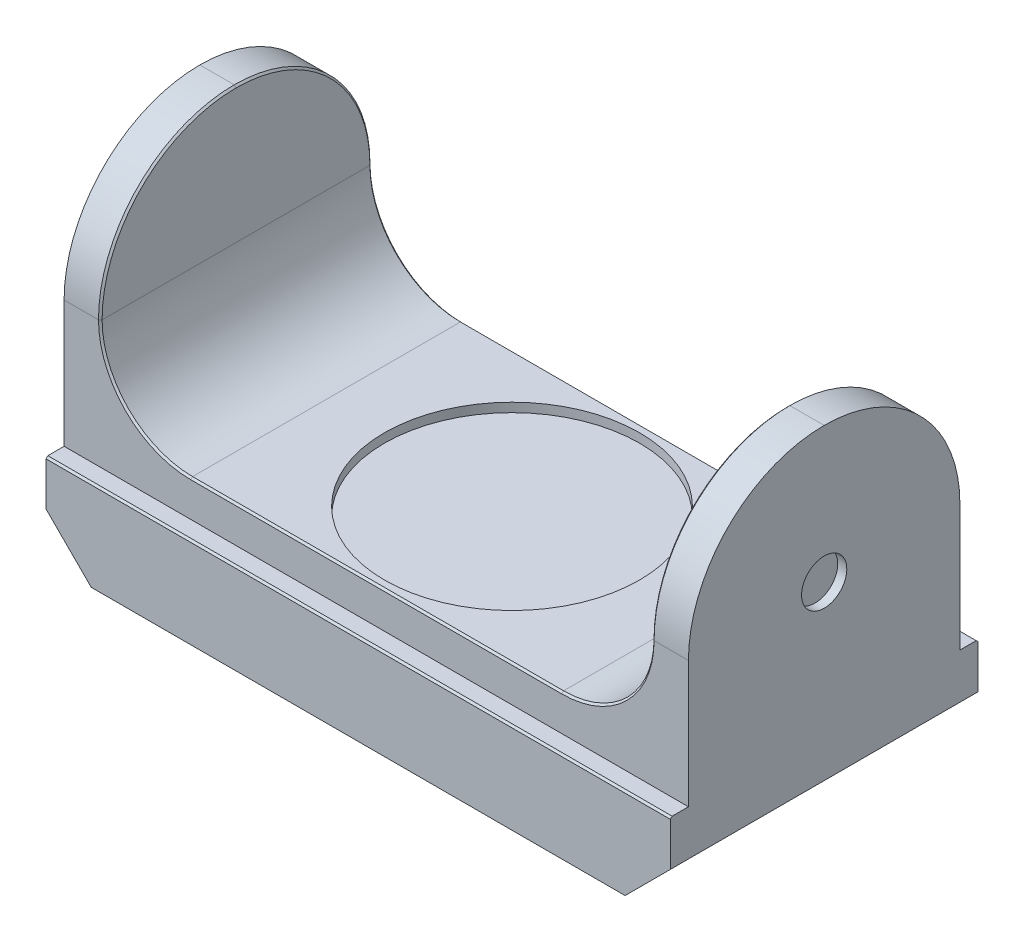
ISO-10303-21;
HEADER;
FILE_DESCRIPTION(('STEP AP214'),'2;1');
FILE_NAME('part.step','',(''),(''),'','','');
FILE_SCHEMA(('AUTOMOTIVE_DESIGN { 1 0 10303 214 1 1 1 1 }'));
ENDSEC;
DATA;
#1=APPLICATION_CONTEXT('core data for automotive mechanical design processes');
#2=APPLICATION_PROTOCOL_DEFINITION('international standard','automotive_design',2000,#1);
#3=PRODUCT_CONTEXT('',#1,'mechanical');
#4=PRODUCT('Part','Part','',(#3));
#5=PRODUCT_RELATED_PRODUCT_CATEGORY('part','',(#4));
#6=PRODUCT_DEFINITION_FORMATION('','',#4);
#7=PRODUCT_DEFINITION_CONTEXT('part definition',#1,'design');
#8=PRODUCT_DEFINITION('design','',#6,#7);
#9=PRODUCT_DEFINITION_SHAPE('','',#8);
#10=(LENGTH_UNIT() NAMED_UNIT(*) SI_UNIT(.MILLI.,.METRE.));
#11=(NAMED_UNIT(*) PLANE_ANGLE_UNIT() SI_UNIT($,.RADIAN.));
#12=(NAMED_UNIT(*) SI_UNIT($,.STERADIAN.) SOLID_ANGLE_UNIT());
#13=UNCERTAINTY_MEASURE_WITH_UNIT(LENGTH_MEASURE(1.E-05),#10,'distance_accuracy_value','');
#14=(GEOMETRIC_REPRESENTATION_CONTEXT(3) GLOBAL_UNCERTAINTY_ASSIGNED_CONTEXT((#13)) GLOBAL_UNIT_ASSIGNED_CONTEXT((#10,
#11,#12)) REPRESENTATION_CONTEXT('',''));
#15=CARTESIAN_POINT('',(0.,0.,0.));
#16=DIRECTION('',(0.,0.,1.));
#17=DIRECTION('',(1.,0.,0.));
#18=AXIS2_PLACEMENT_3D('',#15,#16,#17);
#19=CARTESIAN_POINT('',(-345.,290.,150.));
#20=DIRECTION('',(1.,0.,0.));
#21=DIRECTION('',(0.,1.,0.));
#22=AXIS2_PLACEMENT_3D('',#19,#20,#21);
#23=PLANE('',#22);
#24=DIRECTION('',(0.,0.,-1.));
#25=VECTOR('',#24,1.);
#26=CARTESIAN_POINT('',(-345.,0.,170.));
#27=LINE('',#26,#25);
#28=CARTESIAN_POINT('',(-345.,0.,-150.));
#29=VERTEX_POINT('',#28);
#30=CARTESIAN_POINT('',(-345.,0.,-168.));
#31=VERTEX_POINT('',#30);
#32=EDGE_CURVE('E192',#29,#31,#27,.T.);
#33=ORIENTED_EDGE('',*,*,#32,.T.);
#34=DIRECTION('',(0.,0.707106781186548,0.707106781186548));
#35=VECTOR('',#34,1.);
#36=CARTESIAN_POINT('',(-345.,0.,-168.));
#37=LINE('',#36,#35);
#38=CARTESIAN_POINT('',(-345.,-2.,-170.));
#39=VERTEX_POINT('',#38);
#40=EDGE_CURVE('E463',#31,#39,#37,.F.);
#41=ORIENTED_EDGE('',*,*,#40,.T.);
#42=DIRECTION('',(0.,-1.,0.));
#43=VECTOR('',#42,1.);
#44=CARTESIAN_POINT('',(-345.,-100.,-170.));
#45=LINE('',#44,#43);
#46=CARTESIAN_POINT('',(-345.,-50.,-170.));
#47=VERTEX_POINT('',#46);
#48=EDGE_CURVE('E444',#39,#47,#45,.T.);
#49=ORIENTED_EDGE('',*,*,#48,.T.);
#50=DIRECTION('',(0.,0.,1.));
#51=VECTOR('',#50,1.);
#52=CARTESIAN_POINT('',(-345.,-50.,150.));
#53=LINE('',#52,#51);
#54=CARTESIAN_POINT('',(-345.,-50.,170.));
#55=VERTEX_POINT('',#54);
#56=EDGE_CURVE('E290',#47,#55,#53,.T.);
#57=ORIENTED_EDGE('',*,*,#56,.T.);
#58=DIRECTION('',(0.,-1.,0.));
#59=VECTOR('',#58,1.);
#60=CARTESIAN_POINT('',(-345.,-100.,170.));
#61=LINE('',#60,#59);
#62=CARTESIAN_POINT('',(-345.,-2.00000000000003,170.));
#63=VERTEX_POINT('',#62);
#64=EDGE_CURVE('E451',#63,#55,#61,.T.);
#65=ORIENTED_EDGE('',*,*,#64,.F.);
#66=DIRECTION('',(0.,0.707106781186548,-0.707106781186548));
#67=VECTOR('',#66,1.);
#68=CARTESIAN_POINT('',(-345.,-2.,170.));
#69=LINE('',#68,#67);
#70=CARTESIAN_POINT('',(-345.,0.,168.));
#71=VERTEX_POINT('',#70);
#72=EDGE_CURVE('E188',#63,#71,#69,.T.);
#73=ORIENTED_EDGE('',*,*,#72,.T.);
#74=CARTESIAN_POINT('',(-345.,0.,150.));
#75=VERTEX_POINT('',#74);
#76=EDGE_CURVE('E181',#71,#75,#27,.T.);
#77=ORIENTED_EDGE('',*,*,#76,.T.);
#78=DIRECTION('',(0.,-1.,0.));
#79=VECTOR('',#78,1.);
#80=CARTESIAN_POINT('',(-345.,290.,150.));
#81=LINE('',#80,#79);
#82=CARTESIAN_POINT('',(-345.,140.,150.));
#83=VERTEX_POINT('',#82);
#84=EDGE_CURVE('E185',#83,#75,#81,.T.);
#85=ORIENTED_EDGE('',*,*,#84,.F.);
#86=CARTESIAN_POINT('',(-345.,140.,0.));
#87=DIRECTION('',(1.,0.,0.));
#88=DIRECTION('',(0.,1.,0.));
#89=AXIS2_PLACEMENT_3D('',#86,#87,#88);
#90=CIRCLE('',#89,150.);
#91=CARTESIAN_POINT('',(-345.,290.,0.));
#92=VERTEX_POINT('',#91);
#93=EDGE_CURVE('E263',#83,#92,#90,.F.);
#94=ORIENTED_EDGE('',*,*,#93,.T.);
#95=CARTESIAN_POINT('',(-345.,140.,0.));
#96=DIRECTION('',(1.,0.,0.));
#97=DIRECTION('',(0.,1.,0.));
#98=AXIS2_PLACEMENT_3D('',#95,#96,#97);
#99=CIRCLE('',#98,150.);
#100=CARTESIAN_POINT('',(-345.,140.,-150.));
#101=VERTEX_POINT('',#100);
#102=EDGE_CURVE('E235',#92,#101,#99,.F.);
#103=ORIENTED_EDGE('',*,*,#102,.T.);
#104=DIRECTION('',(0.,-1.,0.));
#105=VECTOR('',#104,1.);
#106=CARTESIAN_POINT('',(-345.,290.,-150.));
#107=LINE('',#106,#105);
#108=EDGE_CURVE('E218',#101,#29,#107,.T.);
#109=ORIENTED_EDGE('',*,*,#108,.T.);
#110=EDGE_LOOP('',(#33,#41,#49,#57,#65,#73,#77,#85,#94,#103,#109));
#111=FACE_BOUND('',#110,.T.);
#112=ADVANCED_FACE('F26',(#111),#23,.F.);
#113=CARTESIAN_POINT('',(345.,0.,150.));
#114=DIRECTION('',(-1.,0.,0.));
#115=DIRECTION('',(0.,-1.,0.));
#116=AXIS2_PLACEMENT_3D('',#113,#114,#115);
#117=PLANE('',#116);
#118=CARTESIAN_POINT('',(345.,140.,0.));
#119=DIRECTION('',(1.,0.,0.));
#120=DIRECTION('',(0.,1.,0.));
#121=AXIS2_PLACEMENT_3D('',#118,#119,#120);
#122=CIRCLE('',#121,25.);
#123=CARTESIAN_POINT('',(345.,165.,0.));
#124=VERTEX_POINT('',#123);
#125=EDGE_CURVE('E438',#124,#124,#122,.T.);
#126=ORIENTED_EDGE('',*,*,#125,.F.);
#127=EDGE_LOOP('',(#126));
#128=FACE_BOUND('',#127,.T.);
#129=DIRECTION('',(0.,1.,0.));
#130=VECTOR('',#129,1.);
#131=CARTESIAN_POINT('',(345.,0.,-170.));
#132=LINE('',#131,#130);
#133=CARTESIAN_POINT('',(345.,-50.0000000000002,-170.));
#134=VERTEX_POINT('',#133);
#135=CARTESIAN_POINT('',(345.,-1.99999999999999,-170.));
#136=VERTEX_POINT('',#135);
#137=EDGE_CURVE('E449',#134,#136,#132,.T.);
#138=ORIENTED_EDGE('',*,*,#137,.T.);
#139=DIRECTION('',(0.,-0.707106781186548,-0.707106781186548));
#140=VECTOR('',#139,1.);
#141=CARTESIAN_POINT('',(345.,-1.3207825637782E-13,-168.));
#142=LINE('',#141,#140);
#143=CARTESIAN_POINT('',(345.,0.,-168.));
#144=VERTEX_POINT('',#143);
#145=EDGE_CURVE('E317',#136,#144,#142,.F.);
#146=ORIENTED_EDGE('',*,*,#145,.T.);
#147=DIRECTION('',(0.,0.,-1.));
#148=VECTOR('',#147,1.);
#149=CARTESIAN_POINT('',(345.,0.,170.));
#150=LINE('',#149,#148);
#151=CARTESIAN_POINT('',(345.,0.,-150.));
#152=VERTEX_POINT('',#151);
#153=EDGE_CURVE('E191',#152,#144,#150,.T.);
#154=ORIENTED_EDGE('',*,*,#153,.F.);
#155=DIRECTION('',(0.,1.,0.));
#156=VECTOR('',#155,1.);
#157=CARTESIAN_POINT('',(345.,0.,-150.));
#158=LINE('',#157,#156);
#159=CARTESIAN_POINT('',(345.,140.,-150.));
#160=VERTEX_POINT('',#159);
#161=EDGE_CURVE('E207',#152,#160,#158,.T.);
#162=ORIENTED_EDGE('',*,*,#161,.T.);
#163=CARTESIAN_POINT('',(345.,140.,0.));
#164=DIRECTION('',(-1.,0.,0.));
#165=DIRECTION('',(0.,-1.,0.));
#166=AXIS2_PLACEMENT_3D('',#163,#164,#165);
#167=CIRCLE('',#166,150.);
#168=CARTESIAN_POINT('',(345.,290.,0.));
#169=VERTEX_POINT('',#168);
#170=EDGE_CURVE('E258',#160,#169,#167,.F.);
#171=ORIENTED_EDGE('',*,*,#170,.T.);
#172=CARTESIAN_POINT('',(345.,140.,0.));
#173=DIRECTION('',(-1.,0.,0.));
#174=DIRECTION('',(0.,-1.,0.));
#175=AXIS2_PLACEMENT_3D('',#172,#173,#174);
#176=CIRCLE('',#175,150.);
#177=CARTESIAN_POINT('',(345.,140.,150.));
#178=VERTEX_POINT('',#177);
#179=EDGE_CURVE('E256',#169,#178,#176,.F.);
#180=ORIENTED_EDGE('',*,*,#179,.T.);
#181=DIRECTION('',(0.,1.,0.));
#182=VECTOR('',#181,1.);
#183=CARTESIAN_POINT('',(345.,0.,150.));
#184=LINE('',#183,#182);
#185=CARTESIAN_POINT('',(345.,0.,150.));
#186=VERTEX_POINT('',#185);
#187=EDGE_CURVE('E202',#186,#178,#184,.T.);
#188=ORIENTED_EDGE('',*,*,#187,.F.);
#189=CARTESIAN_POINT('',(345.,0.,168.));
#190=VERTEX_POINT('',#189);
#191=EDGE_CURVE('E198',#190,#186,#150,.T.);
#192=ORIENTED_EDGE('',*,*,#191,.F.);
#193=DIRECTION('',(0.,-0.707106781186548,0.707106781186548));
#194=VECTOR('',#193,1.);
#195=CARTESIAN_POINT('',(345.,-2.00000000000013,170.));
#196=LINE('',#195,#194);
#197=CARTESIAN_POINT('',(345.,-1.99999999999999,170.));
#198=VERTEX_POINT('',#197);
#199=EDGE_CURVE('E315',#190,#198,#196,.T.);
#200=ORIENTED_EDGE('',*,*,#199,.T.);
#201=DIRECTION('',(0.,1.,0.));
#202=VECTOR('',#201,1.);
#203=CARTESIAN_POINT('',(345.,0.,170.));
#204=LINE('',#203,#202);
#205=CARTESIAN_POINT('',(345.,-50.,170.));
#206=VERTEX_POINT('',#205);
#207=EDGE_CURVE('E301',#206,#198,#204,.T.);
#208=ORIENTED_EDGE('',*,*,#207,.F.);
#209=DIRECTION('',(0.,0.,-1.));
#210=VECTOR('',#209,1.);
#211=CARTESIAN_POINT('',(345.,-50.0000000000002,150.));
#212=LINE('',#211,#210);
#213=EDGE_CURVE('E264',#206,#134,#212,.T.);
#214=ORIENTED_EDGE('',*,*,#213,.T.);
#215=EDGE_LOOP('',(#138,#146,#154,#162,#171,#180,#188,#192,#200,#208,#214));
#216=FACE_BOUND('',#215,.T.);
#217=ADVANCED_FACE('F470',(#128,#216),#117,.F.);
#218=CARTESIAN_POINT('',(305.,290.,150.));
#219=DIRECTION('',(1.,0.,0.));
#220=DIRECTION('',(0.,0.,-1.));
#221=AXIS2_PLACEMENT_3D('',#218,#219,#220);
#222=PLANE('',#221);
#223=CARTESIAN_POINT('',(305.,140.,0.));
#224=DIRECTION('',(1.,0.,0.));
#225=DIRECTION('',(0.,0.,-1.));
#226=AXIS2_PLACEMENT_3D('',#223,#224,#225);
#227=CIRCLE('',#226,148.);
#228=CARTESIAN_POINT('',(305.,140.000000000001,148.));
#229=VERTEX_POINT('',#228);
#230=CARTESIAN_POINT('',(305.,288.,0.));
#231=VERTEX_POINT('',#230);
#232=EDGE_CURVE('E336',#229,#231,#227,.F.);
#233=ORIENTED_EDGE('',*,*,#232,.T.);
#234=CARTESIAN_POINT('',(305.,140.,0.));
#235=DIRECTION('',(1.,0.,0.));
#236=DIRECTION('',(0.,0.,-1.));
#237=AXIS2_PLACEMENT_3D('',#234,#235,#236);
#238=CIRCLE('',#237,148.);
#239=CARTESIAN_POINT('',(305.,140.000000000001,-148.));
#240=VERTEX_POINT('',#239);
#241=EDGE_CURVE('E338',#231,#240,#238,.F.);
#242=ORIENTED_EDGE('',*,*,#241,.T.);
#243=DIRECTION('',(0.,0.,-1.));
#244=VECTOR('',#243,1.);
#245=CARTESIAN_POINT('',(305.,140.000000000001,150.));
#246=LINE('',#245,#244);
#247=EDGE_CURVE('E246',#229,#240,#246,.T.);
#248=ORIENTED_EDGE('',*,*,#247,.F.);
#249=EDGE_LOOP('',(#233,#242,#248));
#250=FACE_BOUND('',#249,.T.);
#251=ADVANCED_FACE('F495',(#250),#222,.F.);
#252=CARTESIAN_POINT('',(205.,140.,150.));
#253=DIRECTION('',(0.,0.,-1.));
#254=DIRECTION('',(-1.,0.,0.));
#255=AXIS2_PLACEMENT_3D('',#252,#253,#254);
#256=CYLINDRICAL_SURFACE('',#255,100.);
#257=ORIENTED_EDGE('',*,*,#247,.T.);
#258=CARTESIAN_POINT('',(205.,140.,-148.));
#259=DIRECTION('',(0.,0.,-1.));
#260=DIRECTION('',(-1.,0.,0.));
#261=AXIS2_PLACEMENT_3D('',#258,#259,#260);
#262=CIRCLE('',#261,100.);
#263=CARTESIAN_POINT('',(204.999999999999,39.9999999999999,-148.));
#264=VERTEX_POINT('',#263);
#265=EDGE_CURVE('E326',#240,#264,#262,.T.);
#266=ORIENTED_EDGE('',*,*,#265,.T.);
#267=DIRECTION('',(0.,0.,-1.));
#268=VECTOR('',#267,1.);
#269=CARTESIAN_POINT('',(204.999999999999,39.9999999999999,150.));
#270=LINE('',#269,#268);
#271=CARTESIAN_POINT('',(204.999999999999,39.9999999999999,148.));
#272=VERTEX_POINT('',#271);
#273=EDGE_CURVE('E241',#272,#264,#270,.T.);
#274=ORIENTED_EDGE('',*,*,#273,.F.);
#275=CARTESIAN_POINT('',(205.,140.,148.));
#276=DIRECTION('',(0.,0.,-1.));
#277=DIRECTION('',(-1.,0.,0.));
#278=AXIS2_PLACEMENT_3D('',#275,#276,#277);
#279=CIRCLE('',#278,100.);
#280=EDGE_CURVE('E324',#272,#229,#279,.F.);
#281=ORIENTED_EDGE('',*,*,#280,.T.);
#282=EDGE_LOOP('',(#257,#266,#274,#281));
#283=FACE_BOUND('',#282,.T.);
#284=ADVANCED_FACE('F500',(#283),#256,.F.);
#285=CARTESIAN_POINT('',(204.999999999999,39.9999999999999,150.));
#286=DIRECTION('',(0.,-1.,0.));
#287=DIRECTION('',(0.,0.,-1.));
#288=AXIS2_PLACEMENT_3D('',#285,#286,#287);
#289=PLANE('',#288);
#290=CARTESIAN_POINT('',(0.,39.9999999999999,0.));
#291=DIRECTION('',(0.,1.,0.));
#292=DIRECTION('',(0.,0.,1.));
#293=AXIS2_PLACEMENT_3D('',#290,#291,#292);
#294=CIRCLE('',#293,141.);
#295=CARTESIAN_POINT('',(0.,39.9999999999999,141.));
#296=VERTEX_POINT('',#295);
#297=EDGE_CURVE('E432',#296,#296,#294,.T.);
#298=ORIENTED_EDGE('',*,*,#297,.F.);
#299=EDGE_LOOP('',(#298));
#300=FACE_BOUND('',#299,.T.);
#301=ORIENTED_EDGE('',*,*,#273,.T.);
#302=DIRECTION('',(-1.,0.,0.));
#303=VECTOR('',#302,1.);
#304=CARTESIAN_POINT('',(-204.999999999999,39.9999999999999,-148.));
#305=LINE('',#304,#303);
#306=CARTESIAN_POINT('',(-204.999999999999,39.9999999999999,-148.));
#307=VERTEX_POINT('',#306);
#308=EDGE_CURVE('E344',#264,#307,#305,.T.);
#309=ORIENTED_EDGE('',*,*,#308,.T.);
#310=DIRECTION('',(0.,0.,-1.));
#311=VECTOR('',#310,1.);
#312=CARTESIAN_POINT('',(-204.999999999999,39.9999999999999,150.));
#313=LINE('',#312,#311);
#314=CARTESIAN_POINT('',(-204.999999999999,39.9999999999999,148.));
#315=VERTEX_POINT('',#314);
#316=EDGE_CURVE('E238',#315,#307,#313,.T.);
#317=ORIENTED_EDGE('',*,*,#316,.F.);
#318=DIRECTION('',(1.,0.,0.));
#319=VECTOR('',#318,1.);
#320=CARTESIAN_POINT('',(204.999999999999,39.9999999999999,148.));
#321=LINE('',#320,#319);
#322=EDGE_CURVE('E342',#315,#272,#321,.T.);
#323=ORIENTED_EDGE('',*,*,#322,.T.);
#324=EDGE_LOOP('',(#301,#309,#317,#323));
#325=FACE_BOUND('',#324,.T.);
#326=ADVANCED_FACE('F507',(#300,#325),#289,.F.);
#327=CARTESIAN_POINT('',(-205.,140.,150.));
#328=DIRECTION('',(0.,0.,-1.));
#329=DIRECTION('',(-1.,0.,0.));
#330=AXIS2_PLACEMENT_3D('',#327,#328,#329);
#331=CYLINDRICAL_SURFACE('',#330,100.);
#332=ORIENTED_EDGE('',*,*,#316,.T.);
#333=CARTESIAN_POINT('',(-205.,140.,-148.));
#334=DIRECTION('',(0.,0.,-1.));
#335=DIRECTION('',(-1.,0.,0.));
#336=AXIS2_PLACEMENT_3D('',#333,#334,#335);
#337=CIRCLE('',#336,100.);
#338=CARTESIAN_POINT('',(-305.,140.000000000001,-148.));
#339=VERTEX_POINT('',#338);
#340=EDGE_CURVE('E350',#307,#339,#337,.T.);
#341=ORIENTED_EDGE('',*,*,#340,.T.);
#342=DIRECTION('',(0.,0.,-1.));
#343=VECTOR('',#342,1.);
#344=CARTESIAN_POINT('',(-305.,140.000000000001,150.));
#345=LINE('',#344,#343);
#346=CARTESIAN_POINT('',(-305.,140.000000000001,148.));
#347=VERTEX_POINT('',#346);
#348=EDGE_CURVE('E232',#347,#339,#345,.T.);
#349=ORIENTED_EDGE('',*,*,#348,.F.);
#350=CARTESIAN_POINT('',(-205.,140.,148.));
#351=DIRECTION('',(0.,0.,-1.));
#352=DIRECTION('',(-1.,0.,0.));
#353=AXIS2_PLACEMENT_3D('',#350,#351,#352);
#354=CIRCLE('',#353,100.);
#355=EDGE_CURVE('E348',#347,#315,#354,.F.);
#356=ORIENTED_EDGE('',*,*,#355,.T.);
#357=EDGE_LOOP('',(#332,#341,#349,#356));
#358=FACE_BOUND('',#357,.T.);
#359=ADVANCED_FACE('F511',(#358),#331,.F.);
#360=CARTESIAN_POINT('',(-305.,140.000000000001,150.));
#361=DIRECTION('',(-1.,0.,0.));
#362=DIRECTION('',(0.,0.,1.));
#363=AXIS2_PLACEMENT_3D('',#360,#361,#362);
#364=PLANE('',#363);
#365=ORIENTED_EDGE('',*,*,#348,.T.);
#366=CARTESIAN_POINT('',(-305.,140.,0.));
#367=DIRECTION('',(-1.,0.,0.));
#368=DIRECTION('',(0.,0.,1.));
#369=AXIS2_PLACEMENT_3D('',#366,#367,#368);
#370=CIRCLE('',#369,148.);
#371=CARTESIAN_POINT('',(-305.,288.,0.));
#372=VERTEX_POINT('',#371);
#373=EDGE_CURVE('E46',#339,#372,#370,.F.);
#374=ORIENTED_EDGE('',*,*,#373,.T.);
#375=CARTESIAN_POINT('',(-305.,140.,0.));
#376=DIRECTION('',(-1.,0.,0.));
#377=DIRECTION('',(0.,0.,1.));
#378=AXIS2_PLACEMENT_3D('',#375,#376,#377);
#379=CIRCLE('',#378,148.);
#380=EDGE_CURVE('E358',#372,#347,#379,.F.);
#381=ORIENTED_EDGE('',*,*,#380,.T.);
#382=EDGE_LOOP('',(#365,#374,#381));
#383=FACE_BOUND('',#382,.T.);
#384=ADVANCED_FACE('F515',(#383),#364,.F.);
#385=CARTESIAN_POINT('',(205.,140.,150.));
#386=DIRECTION('',(0.,0.,-1.));
#387=DIRECTION('',(-1.,0.,0.));
#388=AXIS2_PLACEMENT_3D('',#385,#386,#387);
#389=PLANE('',#388);
#390=DIRECTION('',(-1.,0.,0.));
#391=VECTOR('',#390,1.);
#392=CARTESIAN_POINT('',(205.,140.,150.));
#393=LINE('',#392,#391);
#394=CARTESIAN_POINT('',(307.,140.,150.));
#395=VERTEX_POINT('',#394);
#396=EDGE_CURVE('E262',#178,#395,#393,.T.);
#397=ORIENTED_EDGE('',*,*,#396,.T.);
#398=CARTESIAN_POINT('',(205.,140.,150.));
#399=DIRECTION('',(0.,0.,-1.));
#400=DIRECTION('',(-1.,0.,0.));
#401=AXIS2_PLACEMENT_3D('',#398,#399,#400);
#402=CIRCLE('',#401,102.);
#403=CARTESIAN_POINT('',(204.999999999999,38.0000000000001,150.));
#404=VERTEX_POINT('',#403);
#405=EDGE_CURVE('E356',#395,#404,#402,.T.);
#406=ORIENTED_EDGE('',*,*,#405,.T.);
#407=DIRECTION('',(-1.,0.,0.));
#408=VECTOR('',#407,1.);
#409=CARTESIAN_POINT('',(205.,38.0000000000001,150.));
#410=LINE('',#409,#408);
#411=CARTESIAN_POINT('',(-204.999999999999,38.0000000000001,150.));
#412=VERTEX_POINT('',#411);
#413=EDGE_CURVE('E354',#404,#412,#410,.T.);
#414=ORIENTED_EDGE('',*,*,#413,.T.);
#415=CARTESIAN_POINT('',(-205.,140.,150.));
#416=DIRECTION('',(0.,0.,-1.));
#417=DIRECTION('',(-1.,0.,0.));
#418=AXIS2_PLACEMENT_3D('',#415,#416,#417);
#419=CIRCLE('',#418,102.);
#420=CARTESIAN_POINT('',(-307.,140.,150.));
#421=VERTEX_POINT('',#420);
#422=EDGE_CURVE('E352',#412,#421,#419,.T.);
#423=ORIENTED_EDGE('',*,*,#422,.T.);
#424=DIRECTION('',(-1.,0.,0.));
#425=VECTOR('',#424,1.);
#426=CARTESIAN_POINT('',(205.,140.,150.));
#427=LINE('',#426,#425);
#428=EDGE_CURVE('E206',#421,#83,#427,.T.);
#429=ORIENTED_EDGE('',*,*,#428,.T.);
#430=ORIENTED_EDGE('',*,*,#84,.T.);
#431=DIRECTION('',(1.,0.,0.));
#432=VECTOR('',#431,1.);
#433=CARTESIAN_POINT('',(-345.,0.,150.));
#434=LINE('',#433,#432);
#435=EDGE_CURVE('E195',#75,#186,#434,.T.);
#436=ORIENTED_EDGE('',*,*,#435,.T.);
#437=ORIENTED_EDGE('',*,*,#187,.T.);
#438=EDGE_LOOP('',(#397,#406,#414,#423,#429,#430,#436,#437));
#439=FACE_BOUND('',#438,.T.);
#440=ADVANCED_FACE('F205',(#439),#389,.F.);
#441=CARTESIAN_POINT('',(205.,140.,-150.));
#442=DIRECTION('',(0.,0.,-1.));
#443=DIRECTION('',(-1.,0.,0.));
#444=AXIS2_PLACEMENT_3D('',#441,#442,#443);
#445=PLANE('',#444);
#446=DIRECTION('',(1.,0.,0.));
#447=VECTOR('',#446,1.);
#448=CARTESIAN_POINT('',(204.999999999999,38.0000000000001,-150.));
#449=LINE('',#448,#447);
#450=CARTESIAN_POINT('',(-204.999999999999,38.0000000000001,-150.));
#451=VERTEX_POINT('',#450);
#452=CARTESIAN_POINT('',(204.999999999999,38.0000000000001,-150.));
#453=VERTEX_POINT('',#452);
#454=EDGE_CURVE('E331',#451,#453,#449,.T.);
#455=ORIENTED_EDGE('',*,*,#454,.T.);
#456=CARTESIAN_POINT('',(205.,140.,-150.));
#457=DIRECTION('',(0.,0.,-1.));
#458=DIRECTION('',(-1.,0.,0.));
#459=AXIS2_PLACEMENT_3D('',#456,#457,#458);
#460=CIRCLE('',#459,102.);
#461=CARTESIAN_POINT('',(307.,140.,-150.));
#462=VERTEX_POINT('',#461);
#463=EDGE_CURVE('E333',#453,#462,#460,.F.);
#464=ORIENTED_EDGE('',*,*,#463,.T.);
#465=DIRECTION('',(-1.,0.,0.));
#466=VECTOR('',#465,1.);
#467=CARTESIAN_POINT('',(345.,140.,-150.));
#468=LINE('',#467,#466);
#469=EDGE_CURVE('E254',#462,#160,#468,.F.);
#470=ORIENTED_EDGE('',*,*,#469,.T.);
#471=ORIENTED_EDGE('',*,*,#161,.F.);
#472=DIRECTION('',(1.,0.,0.));
#473=VECTOR('',#472,1.);
#474=CARTESIAN_POINT('',(-345.,0.,-150.));
#475=LINE('',#474,#473);
#476=EDGE_CURVE('E210',#29,#152,#475,.T.);
#477=ORIENTED_EDGE('',*,*,#476,.F.);
#478=ORIENTED_EDGE('',*,*,#108,.F.);
#479=DIRECTION('',(-1.,0.,0.));
#480=VECTOR('',#479,1.);
#481=CARTESIAN_POINT('',(-305.,140.,-150.));
#482=LINE('',#481,#480);
#483=CARTESIAN_POINT('',(-307.,140.,-150.));
#484=VERTEX_POINT('',#483);
#485=EDGE_CURVE('E251',#101,#484,#482,.F.);
#486=ORIENTED_EDGE('',*,*,#485,.T.);
#487=CARTESIAN_POINT('',(-205.,140.,-150.));
#488=DIRECTION('',(0.,0.,-1.));
#489=DIRECTION('',(-1.,0.,0.));
#490=AXIS2_PLACEMENT_3D('',#487,#488,#489);
#491=CIRCLE('',#490,102.);
#492=EDGE_CURVE('E329',#484,#451,#491,.F.);
#493=ORIENTED_EDGE('',*,*,#492,.T.);
#494=EDGE_LOOP('',(#455,#464,#470,#471,#477,#478,#486,#493));
#495=FACE_BOUND('',#494,.T.);
#496=ADVANCED_FACE('F367',(#495),#445,.T.);
#497=CARTESIAN_POINT('',(205.,140.,0.));
#498=DIRECTION('',(-1.,0.,0.));
#499=DIRECTION('',(0.,0.,1.));
#500=AXIS2_PLACEMENT_3D('',#497,#498,#499);
#501=CYLINDRICAL_SURFACE('',#500,150.);
#502=DIRECTION('',(-1.,0.,0.));
#503=VECTOR('',#502,1.);
#504=CARTESIAN_POINT('',(345.,290.,0.));
#505=LINE('',#504,#503);
#506=CARTESIAN_POINT('',(307.,290.,0.));
#507=VERTEX_POINT('',#506);
#508=EDGE_CURVE('E221',#507,#169,#505,.F.);
#509=ORIENTED_EDGE('',*,*,#508,.F.);
#510=CARTESIAN_POINT('',(307.,140.,0.));
#511=DIRECTION('',(1.,0.,0.));
#512=DIRECTION('',(0.,0.,-1.));
#513=AXIS2_PLACEMENT_3D('',#510,#511,#512);
#514=CIRCLE('',#513,150.);
#515=EDGE_CURVE('E346',#507,#395,#514,.T.);
#516=ORIENTED_EDGE('',*,*,#515,.T.);
#517=ORIENTED_EDGE('',*,*,#396,.F.);
#518=ORIENTED_EDGE('',*,*,#179,.F.);
#519=EDGE_LOOP('',(#509,#516,#517,#518));
#520=FACE_BOUND('',#519,.T.);
#521=ADVANCED_FACE('F409',(#520),#501,.T.);
#522=CARTESIAN_POINT('',(345.,140.,0.));
#523=DIRECTION('',(1.,0.,0.));
#524=DIRECTION('',(0.,0.,-1.));
#525=AXIS2_PLACEMENT_3D('',#522,#523,#524);
#526=CYLINDRICAL_SURFACE('',#525,150.);
#527=ORIENTED_EDGE('',*,*,#469,.F.);
#528=CARTESIAN_POINT('',(307.,140.,0.));
#529=DIRECTION('',(1.,0.,0.));
#530=DIRECTION('',(0.,0.,-1.));
#531=AXIS2_PLACEMENT_3D('',#528,#529,#530);
#532=CIRCLE('',#531,150.);
#533=EDGE_CURVE('E340',#462,#507,#532,.T.);
#534=ORIENTED_EDGE('',*,*,#533,.T.);
#535=ORIENTED_EDGE('',*,*,#508,.T.);
#536=ORIENTED_EDGE('',*,*,#170,.F.);
#537=EDGE_LOOP('',(#527,#534,#535,#536));
#538=FACE_BOUND('',#537,.T.);
#539=ADVANCED_FACE('F404',(#538),#526,.T.);
#540=CARTESIAN_POINT('',(205.,140.,0.));
#541=DIRECTION('',(-1.,0.,0.));
#542=DIRECTION('',(0.,0.,1.));
#543=AXIS2_PLACEMENT_3D('',#540,#541,#542);
#544=CYLINDRICAL_SURFACE('',#543,150.);
#545=ORIENTED_EDGE('',*,*,#428,.F.);
#546=CARTESIAN_POINT('',(-307.,140.,0.));
#547=DIRECTION('',(-1.,0.,0.));
#548=DIRECTION('',(0.,0.,1.));
#549=AXIS2_PLACEMENT_3D('',#546,#547,#548);
#550=CIRCLE('',#549,150.);
#551=CARTESIAN_POINT('',(-307.,290.,0.));
#552=VERTEX_POINT('',#551);
#553=EDGE_CURVE('E11',#421,#552,#550,.T.);
#554=ORIENTED_EDGE('',*,*,#553,.T.);
#555=DIRECTION('',(-1.,0.,0.));
#556=VECTOR('',#555,1.);
#557=CARTESIAN_POINT('',(-305.,290.,0.));
#558=LINE('',#557,#556);
#559=EDGE_CURVE('E308',#92,#552,#558,.F.);
#560=ORIENTED_EDGE('',*,*,#559,.F.);
#561=ORIENTED_EDGE('',*,*,#93,.F.);
#562=EDGE_LOOP('',(#545,#554,#560,#561));
#563=FACE_BOUND('',#562,.T.);
#564=ADVANCED_FACE('F487',(#563),#544,.T.);
#565=CARTESIAN_POINT('',(-305.,140.,0.));
#566=DIRECTION('',(1.,0.,0.));
#567=DIRECTION('',(0.,0.,-1.));
#568=AXIS2_PLACEMENT_3D('',#565,#566,#567);
#569=CYLINDRICAL_SURFACE('',#568,150.);
#570=ORIENTED_EDGE('',*,*,#559,.T.);
#571=CARTESIAN_POINT('',(-307.,140.,0.));
#572=DIRECTION('',(-1.,0.,0.));
#573=DIRECTION('',(0.,0.,1.));
#574=AXIS2_PLACEMENT_3D('',#571,#572,#573);
#575=CIRCLE('',#574,150.);
#576=EDGE_CURVE('E33',#552,#484,#575,.T.);
#577=ORIENTED_EDGE('',*,*,#576,.T.);
#578=ORIENTED_EDGE('',*,*,#485,.F.);
#579=ORIENTED_EDGE('',*,*,#102,.F.);
#580=EDGE_LOOP('',(#570,#577,#578,#579));
#581=FACE_BOUND('',#580,.T.);
#582=ADVANCED_FACE('F362',(#581),#569,.T.);
#583=CARTESIAN_POINT('',(-345.,0.,170.));
#584=DIRECTION('',(0.,-1.,0.));
#585=DIRECTION('',(0.,0.,-1.));
#586=AXIS2_PLACEMENT_3D('',#583,#584,#585);
#587=PLANE('',#586);
#588=ORIENTED_EDGE('',*,*,#153,.T.);
#589=DIRECTION('',(-1.,0.,0.));
#590=VECTOR('',#589,1.);
#591=CARTESIAN_POINT('',(-345.,0.,-168.));
#592=LINE('',#591,#590);
#593=EDGE_CURVE('E293',#144,#31,#592,.T.);
#594=ORIENTED_EDGE('',*,*,#593,.T.);
#595=ORIENTED_EDGE('',*,*,#32,.F.);
#596=ORIENTED_EDGE('',*,*,#476,.T.);
#597=EDGE_LOOP('',(#588,#594,#595,#596));
#598=FACE_BOUND('',#597,.T.);
#599=ADVANCED_FACE('F475',(#598),#587,.F.);
#600=CARTESIAN_POINT('',(345.,-100.,170.));
#601=DIRECTION('',(0.,1.,0.));
#602=DIRECTION('',(-1.,0.,0.));
#603=AXIS2_PLACEMENT_3D('',#600,#601,#602);
#604=PLANE('',#603);
#605=DIRECTION('',(1.,0.,0.));
#606=VECTOR('',#605,1.);
#607=CARTESIAN_POINT('',(345.,-100.,-170.));
#608=LINE('',#607,#606);
#609=CARTESIAN_POINT('',(-295.,-100.,-170.));
#610=VERTEX_POINT('',#609);
#611=CARTESIAN_POINT('',(295.,-100.,-170.));
#612=VERTEX_POINT('',#611);
#613=EDGE_CURVE('E446',#610,#612,#608,.T.);
#614=ORIENTED_EDGE('',*,*,#613,.T.);
#615=DIRECTION('',(0.,0.,1.));
#616=VECTOR('',#615,1.);
#617=CARTESIAN_POINT('',(295.,-100.,170.));
#618=LINE('',#617,#616);
#619=CARTESIAN_POINT('',(295.,-99.9999999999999,170.));
#620=VERTEX_POINT('',#619);
#621=EDGE_CURVE('E284',#612,#620,#618,.T.);
#622=ORIENTED_EDGE('',*,*,#621,.T.);
#623=DIRECTION('',(1.,0.,0.));
#624=VECTOR('',#623,1.);
#625=CARTESIAN_POINT('',(345.,-100.,170.));
#626=LINE('',#625,#624);
#627=CARTESIAN_POINT('',(-295.,-100.,170.));
#628=VERTEX_POINT('',#627);
#629=EDGE_CURVE('E452',#628,#620,#626,.T.);
#630=ORIENTED_EDGE('',*,*,#629,.F.);
#631=DIRECTION('',(0.,0.,-1.));
#632=VECTOR('',#631,1.);
#633=CARTESIAN_POINT('',(-295.,-100.,170.));
#634=LINE('',#633,#632);
#635=EDGE_CURVE('E281',#628,#610,#634,.T.);
#636=ORIENTED_EDGE('',*,*,#635,.T.);
#637=EDGE_LOOP('',(#614,#622,#630,#636));
#638=FACE_BOUND('',#637,.T.);
#639=ADVANCED_FACE('F478',(#638),#604,.F.);
#640=ORIENTED_EDGE('',*,*,#76,.F.);
#641=DIRECTION('',(1.,0.,0.));
#642=VECTOR('',#641,1.);
#643=CARTESIAN_POINT('',(345.,0.,168.));
#644=LINE('',#643,#642);
#645=EDGE_CURVE('E322',#71,#190,#644,.T.);
#646=ORIENTED_EDGE('',*,*,#645,.T.);
#647=ORIENTED_EDGE('',*,*,#191,.T.);
#648=ORIENTED_EDGE('',*,*,#435,.F.);
#649=EDGE_LOOP('',(#640,#646,#647,#648));
#650=FACE_BOUND('',#649,.T.);
#651=ADVANCED_FACE('F196',(#650),#587,.F.);
#652=CARTESIAN_POINT('',(-345.,-100.,170.));
#653=DIRECTION('',(0.,0.,1.));
#654=DIRECTION('',(1.,0.,0.));
#655=AXIS2_PLACEMENT_3D('',#652,#653,#654);
#656=PLANE('',#655);
#657=ORIENTED_EDGE('',*,*,#207,.T.);
#658=DIRECTION('',(-1.,0.,0.));
#659=VECTOR('',#658,1.);
#660=CARTESIAN_POINT('',(-345.,-2.,170.));
#661=LINE('',#660,#659);
#662=EDGE_CURVE('E319',#198,#63,#661,.T.);
#663=ORIENTED_EDGE('',*,*,#662,.T.);
#664=ORIENTED_EDGE('',*,*,#64,.T.);
#665=DIRECTION('',(-0.707106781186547,0.707106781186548,0.));
#666=VECTOR('',#665,1.);
#667=CARTESIAN_POINT('',(-320.,-75.0000000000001,170.));
#668=LINE('',#667,#666);
#669=EDGE_CURVE('E286',#55,#628,#668,.F.);
#670=ORIENTED_EDGE('',*,*,#669,.T.);
#671=ORIENTED_EDGE('',*,*,#629,.T.);
#672=DIRECTION('',(-0.707106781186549,-0.707106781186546,0.));
#673=VECTOR('',#672,1.);
#674=CARTESIAN_POINT('',(-25.0000000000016,-420.,170.));
#675=LINE('',#674,#673);
#676=EDGE_CURVE('E288',#620,#206,#675,.F.);
#677=ORIENTED_EDGE('',*,*,#676,.T.);
#678=EDGE_LOOP('',(#657,#663,#664,#670,#671,#677));
#679=FACE_BOUND('',#678,.T.);
#680=ADVANCED_FACE('F459',(#679),#656,.T.);
#681=CARTESIAN_POINT('',(-345.,-100.,-170.));
#682=DIRECTION('',(0.,0.,1.));
#683=DIRECTION('',(1.,0.,0.));
#684=AXIS2_PLACEMENT_3D('',#681,#682,#683);
#685=PLANE('',#684);
#686=ORIENTED_EDGE('',*,*,#48,.F.);
#687=DIRECTION('',(1.,0.,0.));
#688=VECTOR('',#687,1.);
#689=CARTESIAN_POINT('',(-345.,-2.,-170.));
#690=LINE('',#689,#688);
#691=EDGE_CURVE('E314',#39,#136,#690,.T.);
#692=ORIENTED_EDGE('',*,*,#691,.T.);
#693=ORIENTED_EDGE('',*,*,#137,.F.);
#694=DIRECTION('',(0.707106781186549,0.707106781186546,0.));
#695=VECTOR('',#694,1.);
#696=CARTESIAN_POINT('',(345.,-50.0000000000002,-170.));
#697=LINE('',#696,#695);
#698=EDGE_CURVE('E276',#134,#612,#697,.F.);
#699=ORIENTED_EDGE('',*,*,#698,.T.);
#700=ORIENTED_EDGE('',*,*,#613,.F.);
#701=DIRECTION('',(0.707106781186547,-0.707106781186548,0.));
#702=VECTOR('',#701,1.);
#703=CARTESIAN_POINT('',(-295.,-100.,-170.));
#704=LINE('',#703,#702);
#705=EDGE_CURVE('E268',#610,#47,#704,.F.);
#706=ORIENTED_EDGE('',*,*,#705,.T.);
#707=EDGE_LOOP('',(#686,#692,#693,#699,#700,#706));
#708=FACE_BOUND('',#707,.T.);
#709=ADVANCED_FACE('F467',(#708),#685,.F.);
#710=CARTESIAN_POINT('',(345.,-50.0000000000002,150.));
#711=DIRECTION('',(-0.707106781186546,0.707106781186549,0.));
#712=DIRECTION('',(-0.707106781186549,-0.707106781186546,0.));
#713=AXIS2_PLACEMENT_3D('',#710,#711,#712);
#714=PLANE('',#713);
#715=ORIENTED_EDGE('',*,*,#676,.F.);
#716=ORIENTED_EDGE('',*,*,#621,.F.);
#717=ORIENTED_EDGE('',*,*,#698,.F.);
#718=ORIENTED_EDGE('',*,*,#213,.F.);
#719=EDGE_LOOP('',(#715,#716,#717,#718));
#720=FACE_BOUND('',#719,.T.);
#721=ADVANCED_FACE('F582',(#720),#714,.F.);
#722=CARTESIAN_POINT('',(-295.,-100.,170.));
#723=DIRECTION('',(0.707106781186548,0.707106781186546,0.));
#724=DIRECTION('',(-0.707106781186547,0.707106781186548,0.));
#725=AXIS2_PLACEMENT_3D('',#722,#723,#724);
#726=PLANE('',#725);
#727=ORIENTED_EDGE('',*,*,#669,.F.);
#728=ORIENTED_EDGE('',*,*,#56,.F.);
#729=ORIENTED_EDGE('',*,*,#705,.F.);
#730=ORIENTED_EDGE('',*,*,#635,.F.);
#731=EDGE_LOOP('',(#727,#728,#729,#730));
#732=FACE_BOUND('',#731,.T.);
#733=ADVANCED_FACE('F578',(#732),#726,.F.);
#734=CARTESIAN_POINT('',(335.,140.,0.));
#735=DIRECTION('',(1.,0.,0.));
#736=DIRECTION('',(0.,1.,0.));
#737=AXIS2_PLACEMENT_3D('',#734,#735,#736);
#738=CYLINDRICAL_SURFACE('',#737,25.);
#739=CARTESIAN_POINT('',(335.,140.,0.));
#740=DIRECTION('',(1.,0.,0.));
#741=DIRECTION('',(0.,1.,0.));
#742=AXIS2_PLACEMENT_3D('',#739,#740,#741);
#743=CIRCLE('',#742,25.);
#744=CARTESIAN_POINT('',(335.,165.,0.));
#745=VERTEX_POINT('',#744);
#746=EDGE_CURVE('E441',#745,#745,#743,.T.);
#747=ORIENTED_EDGE('',*,*,#746,.F.);
#748=EDGE_LOOP('',(#747));
#749=FACE_BOUND('',#748,.T.);
#750=ORIENTED_EDGE('',*,*,#125,.T.);
#751=EDGE_LOOP('',(#750));
#752=FACE_BOUND('',#751,.T.);
#753=ADVANCED_FACE('F574',(#749,#752),#738,.F.);
#754=CARTESIAN_POINT('',(335.,140.,0.));
#755=DIRECTION('',(1.,0.,0.));
#756=DIRECTION('',(0.,1.,0.));
#757=AXIS2_PLACEMENT_3D('',#754,#755,#756);
#758=PLANE('',#757);
#759=ORIENTED_EDGE('',*,*,#746,.T.);
#760=EDGE_LOOP('',(#759));
#761=FACE_BOUND('',#760,.T.);
#762=ADVANCED_FACE('F570',(#761),#758,.T.);
#763=CARTESIAN_POINT('',(0.,29.9999999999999,0.));
#764=DIRECTION('',(0.,1.,0.));
#765=DIRECTION('',(0.,0.,1.));
#766=AXIS2_PLACEMENT_3D('',#763,#764,#765);
#767=CYLINDRICAL_SURFACE('',#766,141.);
#768=CARTESIAN_POINT('',(0.,29.9999999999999,0.));
#769=DIRECTION('',(0.,1.,0.));
#770=DIRECTION('',(0.,0.,1.));
#771=AXIS2_PLACEMENT_3D('',#768,#769,#770);
#772=CIRCLE('',#771,141.);
#773=CARTESIAN_POINT('',(0.,29.9999999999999,141.));
#774=VERTEX_POINT('',#773);
#775=EDGE_CURVE('E435',#774,#774,#772,.T.);
#776=ORIENTED_EDGE('',*,*,#775,.F.);
#777=EDGE_LOOP('',(#776));
#778=FACE_BOUND('',#777,.T.);
#779=ORIENTED_EDGE('',*,*,#297,.T.);
#780=EDGE_LOOP('',(#779));
#781=FACE_BOUND('',#780,.T.);
#782=ADVANCED_FACE('F566',(#778,#781),#767,.F.);
#783=CARTESIAN_POINT('',(0.,29.9999999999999,0.));
#784=DIRECTION('',(0.,1.,0.));
#785=DIRECTION('',(0.,0.,1.));
#786=AXIS2_PLACEMENT_3D('',#783,#784,#785);
#787=PLANE('',#786);
#788=ORIENTED_EDGE('',*,*,#775,.T.);
#789=EDGE_LOOP('',(#788));
#790=FACE_BOUND('',#789,.T.);
#791=ADVANCED_FACE('F564',(#790),#787,.T.);
#792=CARTESIAN_POINT('',(-345.,0.,-168.));
#793=DIRECTION('',(0.,-0.707106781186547,0.707106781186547));
#794=DIRECTION('',(0.,-0.707106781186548,-0.707106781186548));
#795=AXIS2_PLACEMENT_3D('',#792,#793,#794);
#796=PLANE('',#795);
#797=ORIENTED_EDGE('',*,*,#145,.F.);
#798=ORIENTED_EDGE('',*,*,#691,.F.);
#799=ORIENTED_EDGE('',*,*,#40,.F.);
#800=ORIENTED_EDGE('',*,*,#593,.F.);
#801=EDGE_LOOP('',(#797,#798,#799,#800));
#802=FACE_BOUND('',#801,.T.);
#803=ADVANCED_FACE('F473',(#802),#796,.F.);
#804=CARTESIAN_POINT('',(-345.,-2.,170.));
#805=DIRECTION('',(0.,0.707106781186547,0.707106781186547));
#806=DIRECTION('',(0.,-0.707106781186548,0.707106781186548));
#807=AXIS2_PLACEMENT_3D('',#804,#805,#806);
#808=PLANE('',#807);
#809=ORIENTED_EDGE('',*,*,#199,.F.);
#810=ORIENTED_EDGE('',*,*,#645,.F.);
#811=ORIENTED_EDGE('',*,*,#72,.F.);
#812=ORIENTED_EDGE('',*,*,#662,.F.);
#813=EDGE_LOOP('',(#809,#810,#811,#812));
#814=FACE_BOUND('',#813,.T.);
#815=ADVANCED_FACE('F462',(#814),#808,.T.);
#816=CARTESIAN_POINT('',(-205.,140.,150.));
#817=DIRECTION('',(0.,0.,1.));
#818=DIRECTION('',(1.,0.,0.));
#819=AXIS2_PLACEMENT_3D('',#816,#817,#818);
#820=CONICAL_SURFACE('',#819,102.,0.785398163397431);
#821=DIRECTION('',(0.707106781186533,2.45326946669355E-13,-0.707106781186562));
#822=VECTOR('',#821,1.);
#823=CARTESIAN_POINT('',(-307.,140.,150.));
#824=LINE('',#823,#822);
#825=EDGE_CURVE('E426',#421,#347,#824,.T.);
#826=ORIENTED_EDGE('',*,*,#825,.F.);
#827=ORIENTED_EDGE('',*,*,#422,.F.);
#828=DIRECTION('',(0.,-0.707106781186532,0.707106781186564));
#829=VECTOR('',#828,1.);
#830=CARTESIAN_POINT('',(-204.999999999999,39.9999999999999,148.));
#831=LINE('',#830,#829);
#832=EDGE_CURVE('E429',#315,#412,#831,.T.);
#833=ORIENTED_EDGE('',*,*,#832,.F.);
#834=ORIENTED_EDGE('',*,*,#355,.F.);
#835=EDGE_LOOP('',(#826,#827,#833,#834));
#836=FACE_BOUND('',#835,.T.);
#837=ADVANCED_FACE('F533',(#836),#820,.F.);
#838=CARTESIAN_POINT('',(205.,38.0000000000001,150.));
#839=DIRECTION('',(0.,-0.707106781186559,-0.707106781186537));
#840=DIRECTION('',(0.,0.707106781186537,-0.707106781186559));
#841=AXIS2_PLACEMENT_3D('',#838,#839,#840);
#842=PLANE('',#841);
#843=ORIENTED_EDGE('',*,*,#832,.T.);
#844=ORIENTED_EDGE('',*,*,#413,.F.);
#845=DIRECTION('',(0.,-0.707106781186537,0.707106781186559));
#846=VECTOR('',#845,1.);
#847=CARTESIAN_POINT('',(204.999999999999,39.9999999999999,148.));
#848=LINE('',#847,#846);
#849=EDGE_CURVE('E420',#272,#404,#848,.T.);
#850=ORIENTED_EDGE('',*,*,#849,.F.);
#851=ORIENTED_EDGE('',*,*,#322,.F.);
#852=EDGE_LOOP('',(#843,#844,#850,#851));
#853=FACE_BOUND('',#852,.T.);
#854=ADVANCED_FACE('F543',(#853),#842,.F.);
#855=CARTESIAN_POINT('',(-305.,140.,0.));
#856=DIRECTION('',(-1.,0.,0.));
#857=DIRECTION('',(0.,0.,1.));
#858=AXIS2_PLACEMENT_3D('',#855,#856,#857);
#859=CONICAL_SURFACE('',#858,148.,0.785398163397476);
#860=ORIENTED_EDGE('',*,*,#825,.T.);
#861=ORIENTED_EDGE('',*,*,#380,.F.);
#862=DIRECTION('',(0.707106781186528,-0.707106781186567,0.));
#863=VECTOR('',#862,1.);
#864=CARTESIAN_POINT('',(-307.,290.,0.));
#865=LINE('',#864,#863);
#866=EDGE_CURVE('E418',#552,#372,#865,.T.);
#867=ORIENTED_EDGE('',*,*,#866,.F.);
#868=ORIENTED_EDGE('',*,*,#553,.F.);
#869=EDGE_LOOP('',(#860,#861,#867,#868));
#870=FACE_BOUND('',#869,.T.);
#871=ADVANCED_FACE('F536',(#870),#859,.T.);
#872=CARTESIAN_POINT('',(205.,140.,150.));
#873=DIRECTION('',(0.,0.,1.));
#874=DIRECTION('',(1.,0.,0.));
#875=AXIS2_PLACEMENT_3D('',#872,#873,#874);
#876=CONICAL_SURFACE('',#875,102.,0.785398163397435);
#877=ORIENTED_EDGE('',*,*,#849,.T.);
#878=ORIENTED_EDGE('',*,*,#405,.F.);
#879=DIRECTION('',(0.707106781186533,-2.45326946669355E-13,0.707106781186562));
#880=VECTOR('',#879,1.);
#881=CARTESIAN_POINT('',(305.,140.000000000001,148.));
#882=LINE('',#881,#880);
#883=EDGE_CURVE('E375',#229,#395,#882,.T.);
#884=ORIENTED_EDGE('',*,*,#883,.F.);
#885=ORIENTED_EDGE('',*,*,#280,.F.);
#886=EDGE_LOOP('',(#877,#878,#884,#885));
#887=FACE_BOUND('',#886,.T.);
#888=ADVANCED_FACE('F544',(#887),#876,.F.);
#889=CARTESIAN_POINT('',(-305.,140.,0.));
#890=DIRECTION('',(-1.,0.,0.));
#891=DIRECTION('',(0.,0.,1.));
#892=AXIS2_PLACEMENT_3D('',#889,#890,#891);
#893=CONICAL_SURFACE('',#892,148.,0.785398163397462);
#894=ORIENTED_EDGE('',*,*,#866,.T.);
#895=ORIENTED_EDGE('',*,*,#373,.F.);
#896=DIRECTION('',(0.707106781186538,2.45326946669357E-13,0.707106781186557));
#897=VECTOR('',#896,1.);
#898=CARTESIAN_POINT('',(-307.,140.,-150.));
#899=LINE('',#898,#897);
#900=EDGE_CURVE('E372',#484,#339,#899,.T.);
#901=ORIENTED_EDGE('',*,*,#900,.F.);
#902=ORIENTED_EDGE('',*,*,#576,.F.);
#903=EDGE_LOOP('',(#894,#895,#901,#902));
#904=FACE_BOUND('',#903,.T.);
#905=ADVANCED_FACE('F373',(#904),#893,.T.);
#906=CARTESIAN_POINT('',(305.,140.,0.));
#907=DIRECTION('',(1.,0.,0.));
#908=DIRECTION('',(0.,0.,-1.));
#909=AXIS2_PLACEMENT_3D('',#906,#907,#908);
#910=CONICAL_SURFACE('',#909,148.,0.785398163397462);
#911=ORIENTED_EDGE('',*,*,#883,.T.);
#912=ORIENTED_EDGE('',*,*,#515,.F.);
#913=DIRECTION('',(0.707106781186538,0.707106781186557,0.));
#914=VECTOR('',#913,1.);
#915=CARTESIAN_POINT('',(305.,288.,0.));
#916=LINE('',#915,#914);
#917=EDGE_CURVE('E376',#231,#507,#916,.T.);
#918=ORIENTED_EDGE('',*,*,#917,.F.);
#919=ORIENTED_EDGE('',*,*,#232,.F.);
#920=EDGE_LOOP('',(#911,#912,#918,#919));
#921=FACE_BOUND('',#920,.T.);
#922=ADVANCED_FACE('F412',(#921),#910,.T.);
#923=CARTESIAN_POINT('',(-205.,140.,-148.));
#924=DIRECTION('',(0.,0.,-1.));
#925=DIRECTION('',(-1.,0.,0.));
#926=AXIS2_PLACEMENT_3D('',#923,#924,#925);
#927=CONICAL_SURFACE('',#926,100.,0.785398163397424);
#928=ORIENTED_EDGE('',*,*,#900,.T.);
#929=ORIENTED_EDGE('',*,*,#340,.F.);
#930=DIRECTION('',(0.,0.707106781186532,0.707106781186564));
#931=VECTOR('',#930,1.);
#932=CARTESIAN_POINT('',(-204.999999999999,38.0000000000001,-150.));
#933=LINE('',#932,#931);
#934=EDGE_CURVE('E380',#451,#307,#933,.T.);
#935=ORIENTED_EDGE('',*,*,#934,.F.);
#936=ORIENTED_EDGE('',*,*,#492,.F.);
#937=EDGE_LOOP('',(#928,#929,#935,#936));
#938=FACE_BOUND('',#937,.T.);
#939=ADVANCED_FACE('F378',(#938),#927,.F.);
#940=CARTESIAN_POINT('',(305.,140.,0.));
#941=DIRECTION('',(1.,0.,0.));
#942=DIRECTION('',(0.,0.,-1.));
#943=AXIS2_PLACEMENT_3D('',#940,#941,#942);
#944=CONICAL_SURFACE('',#943,148.,0.785398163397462);
#945=ORIENTED_EDGE('',*,*,#917,.T.);
#946=ORIENTED_EDGE('',*,*,#533,.F.);
#947=DIRECTION('',(0.707106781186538,-2.45326946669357E-13,-0.707106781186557));
#948=VECTOR('',#947,1.);
#949=CARTESIAN_POINT('',(305.,140.000000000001,-148.));
#950=LINE('',#949,#948);
#951=EDGE_CURVE('E384',#240,#462,#950,.T.);
#952=ORIENTED_EDGE('',*,*,#951,.F.);
#953=ORIENTED_EDGE('',*,*,#241,.F.);
#954=EDGE_LOOP('',(#945,#946,#952,#953));
#955=FACE_BOUND('',#954,.T.);
#956=ADVANCED_FACE('F400',(#955),#944,.T.);
#957=CARTESIAN_POINT('',(204.999999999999,39.9999999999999,-148.));
#958=DIRECTION('',(0.,0.707106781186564,-0.707106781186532));
#959=DIRECTION('',(0.,0.707106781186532,0.707106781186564));
#960=AXIS2_PLACEMENT_3D('',#957,#958,#959);
#961=PLANE('',#960);
#962=ORIENTED_EDGE('',*,*,#934,.T.);
#963=ORIENTED_EDGE('',*,*,#308,.F.);
#964=DIRECTION('',(0.,0.707106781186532,0.707106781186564));
#965=VECTOR('',#964,1.);
#966=CARTESIAN_POINT('',(204.999999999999,38.0000000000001,-150.));
#967=LINE('',#966,#965);
#968=EDGE_CURVE('E388',#453,#264,#967,.T.);
#969=ORIENTED_EDGE('',*,*,#968,.F.);
#970=ORIENTED_EDGE('',*,*,#454,.F.);
#971=EDGE_LOOP('',(#962,#963,#969,#970));
#972=FACE_BOUND('',#971,.T.);
#973=ADVANCED_FACE('F387',(#972),#961,.T.);
#974=CARTESIAN_POINT('',(205.,140.,-148.));
#975=DIRECTION('',(0.,0.,-1.));
#976=DIRECTION('',(-1.,0.,0.));
#977=AXIS2_PLACEMENT_3D('',#974,#975,#976);
#978=CONICAL_SURFACE('',#977,100.,0.785398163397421);
#979=ORIENTED_EDGE('',*,*,#951,.T.);
#980=ORIENTED_EDGE('',*,*,#463,.F.);
#981=ORIENTED_EDGE('',*,*,#968,.T.);
#982=ORIENTED_EDGE('',*,*,#265,.F.);
#983=EDGE_LOOP('',(#979,#980,#981,#982));
#984=FACE_BOUND('',#983,.T.);
#985=ADVANCED_FACE('F392',(#984),#978,.F.);
#986=CLOSED_SHELL('',(#112,#217,#251,#284,#326,#359,#384,#440,#496,#521,#539,#564,#582,#599,
#639,#651,#680,#709,#721,#733,#753,#762,#782,#791,#803,#815,#837,#854,#871,#888,#905,#922,#939,
#956,#973,#985));
#987=MANIFOLD_SOLID_BREP('B2',#986);
#988=ADVANCED_BREP_SHAPE_REPRESENTATION('',(#18,#987),#14);
#989=SHAPE_DEFINITION_REPRESENTATION(#9,#988);
ENDSEC;
END-ISO-10303-21;
